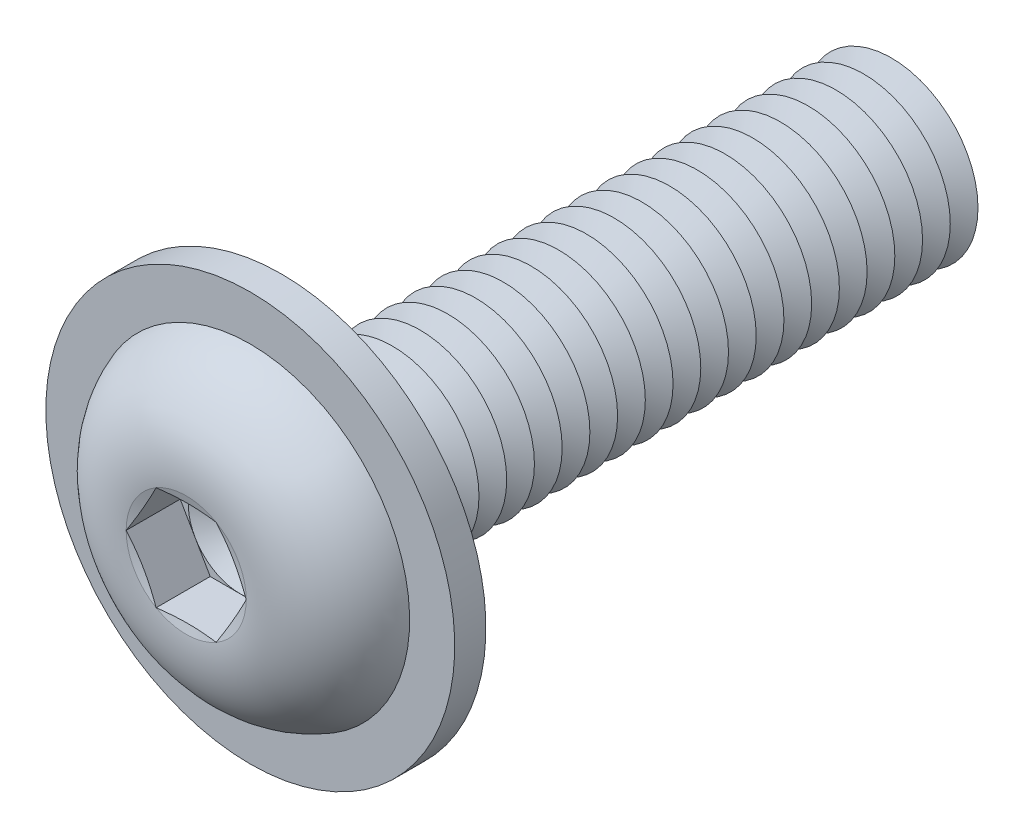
from build123d import *

# Parameters (mm, degrees)
FILLET1_R           = 0.4
LPATTERN1_COUNT     = 22
LPATTERN1_PITCH     = 0.8
CUT_EXTRUDE1_DEPTH  = 1.56
SKETCH5_R           = 5.9
SKETCH5_R_2         = 2.9
BOSS_EXTRUDE1_DEPTH = 0.9


with BuildPart() as part:
    # Sketch1 → Revolve1 (revolve)
    with BuildSketch(Plane(origin=(0, 0, 0), x_dir=(0, 0, -1), z_dir=(1, 0, 0)), mode=Mode.PRIVATE) as revolve1_sk:
        with BuildLine():
            Line((0, 2.5), (0, 4.75))
            ThreePointArc((0, 4.75), (-2.041477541, 3.848329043), (-2.75, 1.73205))
            Line((-2.75, 1.73205), (-2.517949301, 0.866025))
            Line((-2.517949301, 0.866025), (-2.75, 0.866025))
            Line((-2.75, 0.866025), (-2.75, 0))
            Line((-2.75, 0), (18, 0))
            Line((18, 0), (18, 2.5))
            Line((18, 2.5), (0, 2.5))
        make_face()
    revolve(revolve1_sk.sketch.rotate(Axis((0, 0, -18), (0, 0, 1)), 90), axis=Axis((0, 0, -18), (0, 0, 1)))

    # Fillet1
    fillet1_edges = [part.edges().sort_by_distance(p)[0] for p in [
        (2.5, 0, 0),
    ]]
    fillet(fillet1_edges, radius=FILLET1_R)

    # Sketch2 → Cut-Revolve1 (revolve, cut)
    with BuildSketch(Plane(origin=(0, 0, 0), x_dir=(0, 0, -1), z_dir=(1, 0, 0)), mode=Mode.PRIVATE) as cut_revolve1_sk:
        Polygon((17.6, 2.5), (18.4, 2.5), (18, 1.807179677), align=None)
    cut_revolve1 = revolve(cut_revolve1_sk.sketch.rotate(Axis((0, 0, -18), (0, 0, -1)), 270), axis=Axis((0, 0, -18), (0, 0, -1)), mode=Mode.SUBTRACT)

    # LPattern1: Cut-Revolve1 ×22
    with Locations(*[(0, 0, i * LPATTERN1_PITCH) for i in range(1, LPATTERN1_COUNT)]):
        add(cut_revolve1, mode=Mode.SUBTRACT)

    # Sketch3 → Cut-Extrude1 (cut)
    with BuildSketch(Plane.XY.offset(2.75)):
        Polygon((0.866025, 1.499999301), (-0.866025, 1.499999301), (-1.73205, 0), (-0.866025, -1.499999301), (0.866025, -1.499999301), (1.73205, 0), align=None)
    extrude(amount=-CUT_EXTRUDE1_DEPTH, mode=Mode.SUBTRACT)

    # Cut-Extrude2 cone 1 section (on through the dimple's axis) → Cut-Extrude2 (revolve, cut)
    with BuildSketch(Plane(origin=(0, 0, 1.19), x_dir=(0, -1, 0), z_dir=(1, 0, 0))):
        Polygon((0, 0), (1.499999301, 0), (0, 0.866025), align=None)
    revolve(axis=Axis((0, 0, 1.19), (0, 0, -1)), mode=Mode.SUBTRACT)

    # Sketch5 → Boss-Extrude1 (add)
    with BuildSketch(Plane(origin=(0, 0, 0), x_dir=(-1, 0, 0), z_dir=(0, 0, -1))):
        with Locations(Location((0, 0, 0), (0, 0, 90))):
            Circle(SKETCH5_R)
        Circle(SKETCH5_R_2, mode=Mode.SUBTRACT)
    extrude(amount=-BOSS_EXTRUDE1_DEPTH)


solid = part.part
